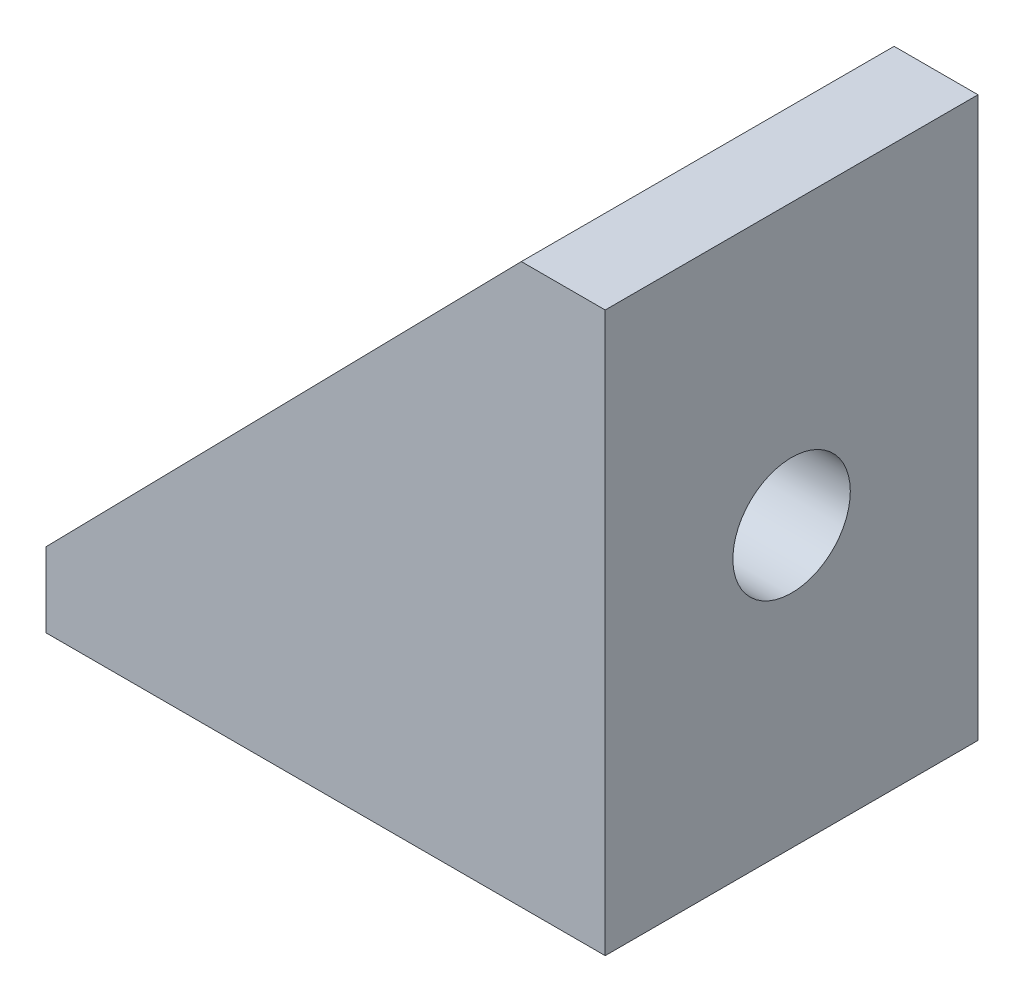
from build123d import *

# Parameters (mm, degrees)
EXTRUDE_1_DEPTH     = 20
SKETCH_2_W          = 31.858698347
SKETCH_2_H          = 14
CUT_EXTRUDE_1_DEPTH = 26
SKETCH_3_R          = 3.15
CUT_EXTRUDE_2_DEPTH = 26
SKETCH_4_R          = 3.15
CUT_EXTRUDE_3_DEPTH = 26


with BuildPart() as part:
    # Sketch 1 → Extrude 1 (new body)
    with BuildSketch(Plane.XY):
        Polygon((0, 0), (30, 0), (30, 30), (25.5, 30), (0, 4), align=None)
    extrude(amount=EXTRUDE_1_DEPTH)

    # Sketch 2 → Cut-Extrude 1 (cut)
    with BuildSketch(Plane(origin=(0, 30, 0), x_dir=(1, 0, 0), z_dir=(0, 1, 0))):
        with Locations((9.570650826, -10)):
            Rectangle(SKETCH_2_W, SKETCH_2_H)
    extrude(amount=-CUT_EXTRUDE_1_DEPTH, mode=Mode.SUBTRACT)

    # Sketch 3 → Cut-Extrude 2 (cut)
    with BuildSketch(Plane(origin=(30, 0, 0), x_dir=(0, 0, -1), z_dir=(1, 0, 0))):
        with Locations((-10, 15)):
            Circle(SKETCH_3_R)
    extrude(amount=-CUT_EXTRUDE_2_DEPTH, mode=Mode.SUBTRACT)

    # Sketch 4 → Cut-Extrude 3 (cut)
    with BuildSketch(Plane.XZ):
        with Locations(Location((12, 10, 0), (0, 0, 270))):
            Circle(SKETCH_4_R)
    extrude(amount=-CUT_EXTRUDE_3_DEPTH, mode=Mode.SUBTRACT)


solid = part.part
